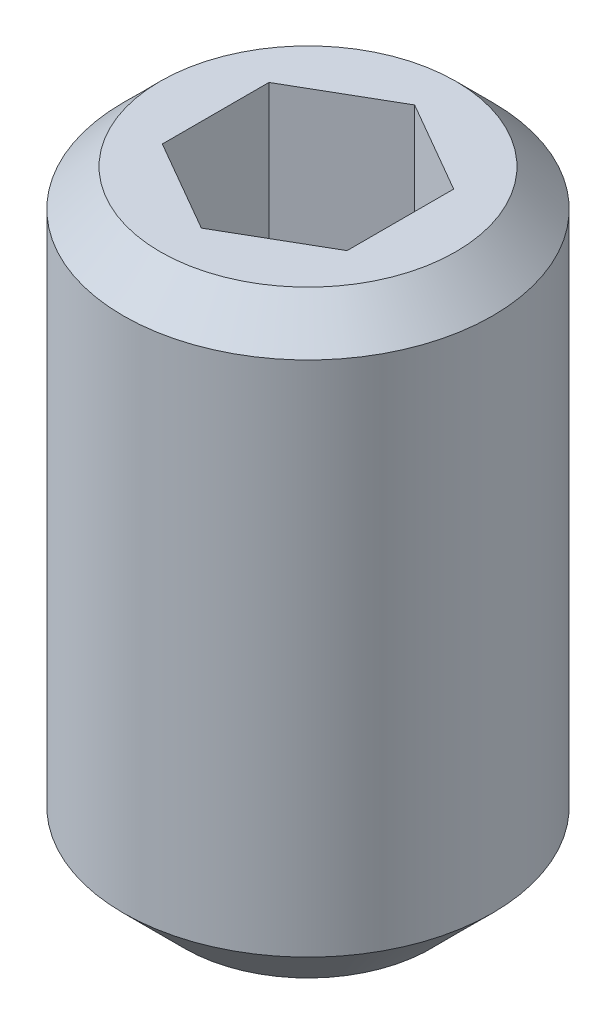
from build123d import *

# Parameters (mm, degrees)
ENL_V_MAT_EXTRU_1_DEPTH = 3


with BuildPart() as part:
    # Esquisse1 → Base-R_volution (revolve)
    with BuildSketch(Plane.XY, mode=Mode.PRIVATE) as base_r_volution_sk:
        Polygon((1.5, 0), (2.4, 0), (3, -0.6), (3, -9), (2, -10), (0, -10), (0, -3.866025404), (1.5, -3), align=None)
    revolve(base_r_volution_sk.sketch.rotate(Axis((0, -10, 0), (0, 1, 0)), 90), axis=Axis((0, -10, 0), (0, 1, 0)))

    # Esquisse2 → Enl_v. mat.-Extru.1 (cut)
    with BuildSketch(Plane(origin=(0, 0, 0), x_dir=(-1, 0, 0), z_dir=(0, 1, 0))):
        Polygon((1.5, -0.866025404), (1.5, 0.866025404), (0, 1.732050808), (-1.5, 0.866025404), (-1.5, -0.866025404), (0, -1.732050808), align=None)
    extrude(amount=-ENL_V_MAT_EXTRU_1_DEPTH, mode=Mode.SUBTRACT)


solid = part.part
